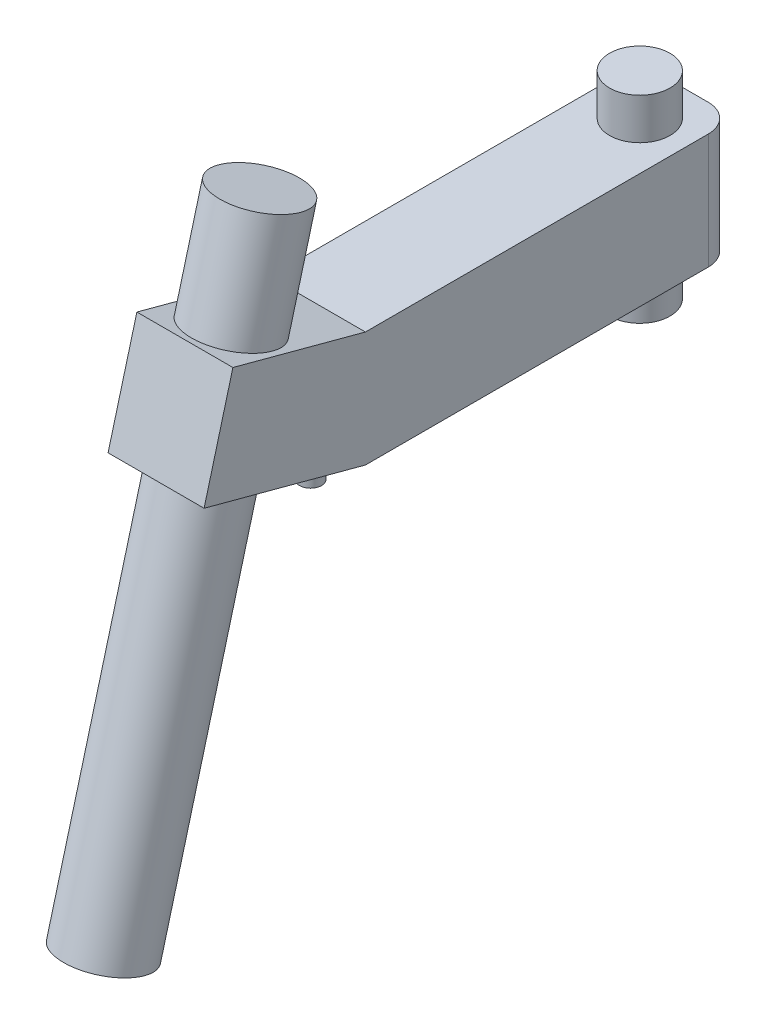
ISO-10303-21;
HEADER;
FILE_DESCRIPTION(('STEP AP214'),'2;1');
FILE_NAME('part.step','',(''),(''),'','','');
FILE_SCHEMA(('AUTOMOTIVE_DESIGN { 1 0 10303 214 1 1 1 1 }'));
ENDSEC;
DATA;
#1=APPLICATION_CONTEXT('core data for automotive mechanical design processes');
#2=APPLICATION_PROTOCOL_DEFINITION('international standard','automotive_design',2000,#1);
#3=PRODUCT_CONTEXT('',#1,'mechanical');
#4=PRODUCT('Part','Part','',(#3));
#5=PRODUCT_RELATED_PRODUCT_CATEGORY('part','',(#4));
#6=PRODUCT_DEFINITION_FORMATION('','',#4);
#7=PRODUCT_DEFINITION_CONTEXT('part definition',#1,'design');
#8=PRODUCT_DEFINITION('design','',#6,#7);
#9=PRODUCT_DEFINITION_SHAPE('','',#8);
#10=(LENGTH_UNIT() NAMED_UNIT(*) SI_UNIT(.MILLI.,.METRE.));
#11=(NAMED_UNIT(*) PLANE_ANGLE_UNIT() SI_UNIT($,.RADIAN.));
#12=(NAMED_UNIT(*) SI_UNIT($,.STERADIAN.) SOLID_ANGLE_UNIT());
#13=UNCERTAINTY_MEASURE_WITH_UNIT(LENGTH_MEASURE(1.E-05),#10,'distance_accuracy_value','');
#14=(GEOMETRIC_REPRESENTATION_CONTEXT(3) GLOBAL_UNCERTAINTY_ASSIGNED_CONTEXT((#13)) GLOBAL_UNIT_ASSIGNED_CONTEXT((#10,
#11,#12)) REPRESENTATION_CONTEXT('',''));
#15=CARTESIAN_POINT('',(0.,0.,0.));
#16=DIRECTION('',(0.,0.,1.));
#17=DIRECTION('',(1.,0.,0.));
#18=AXIS2_PLACEMENT_3D('',#15,#16,#17);
#19=CARTESIAN_POINT('',(87.5,-26.2279061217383,881.481456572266));
#20=DIRECTION('',(0.,0.96592582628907,-0.258819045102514));
#21=DIRECTION('',(0.,0.258819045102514,0.96592582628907));
#22=AXIS2_PLACEMENT_3D('',#19,#20,#21);
#23=PLANE('',#22);
#24=DIRECTION('',(1.,0.,0.));
#25=VECTOR('',#24,1.);
#26=CARTESIAN_POINT('',(-87.4999999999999,-105.,587.5));
#27=LINE('',#26,#25);
#28=CARTESIAN_POINT('',(-15.612494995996,-105.,587.5));
#29=VERTEX_POINT('',#28);
#30=CARTESIAN_POINT('',(15.612494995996,-105.,587.5));
#31=VERTEX_POINT('',#30);
#32=EDGE_CURVE('E12',#29,#31,#27,.T.);
#33=ORIENTED_EDGE('',*,*,#32,.F.);
#34=CARTESIAN_POINT('',(0.,-101.650635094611,600.));
#35=DIRECTION('',(0.,0.96592582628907,-0.258819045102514));
#36=DIRECTION('',(0.,-0.258819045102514,-0.96592582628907));
#37=AXIS2_PLACEMENT_3D('',#34,#35,#36);
#38=ELLIPSE('',#37,20.7055236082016,20.);
#39=EDGE_CURVE('E56',#31,#29,#38,.F.);
#40=ORIENTED_EDGE('',*,*,#39,.F.);
#41=EDGE_LOOP('',(#33,#40));
#42=FACE_BOUND('',#41,.T.);
#43=ADVANCED_FACE('F48',(#42),#23,.T.);
#44=CARTESIAN_POINT('',(0.,180.002,600.));
#45=DIRECTION('',(0.,-1.,0.));
#46=DIRECTION('',(0.,0.,-1.));
#47=AXIS2_PLACEMENT_3D('',#44,#45,#46);
#48=CYLINDRICAL_SURFACE('',#47,20.);
#49=ORIENTED_EDGE('',*,*,#39,.T.);
#50=CARTESIAN_POINT('',(0.,-105.,600.));
#51=DIRECTION('',(0.,-1.,0.));
#52=DIRECTION('',(0.,0.,-1.));
#53=AXIS2_PLACEMENT_3D('',#50,#51,#52);
#54=CIRCLE('',#53,20.);
#55=EDGE_CURVE('E68',#29,#31,#54,.T.);
#56=ORIENTED_EDGE('',*,*,#55,.T.);
#57=EDGE_LOOP('',(#49,#56));
#58=FACE_BOUND('',#57,.T.);
#59=CARTESIAN_POINT('',(0.,-165.,600.));
#60=DIRECTION('',(0.,-1.,0.));
#61=DIRECTION('',(0.,0.,-1.));
#62=AXIS2_PLACEMENT_3D('',#59,#60,#61);
#63=CIRCLE('',#62,20.);
#64=CARTESIAN_POINT('',(0.,-165.,580.));
#65=VERTEX_POINT('',#64);
#66=EDGE_CURVE('E65',#65,#65,#63,.T.);
#67=ORIENTED_EDGE('',*,*,#66,.F.);
#68=EDGE_LOOP('',(#67));
#69=FACE_BOUND('',#68,.T.);
#70=ADVANCED_FACE('F50',(#58,#69),#48,.T.);
#71=CARTESIAN_POINT('',(0.,-105.,600.));
#72=DIRECTION('',(0.,-1.,0.));
#73=DIRECTION('',(0.,0.,-1.));
#74=AXIS2_PLACEMENT_3D('',#71,#72,#73);
#75=PLANE('',#74);
#76=ORIENTED_EDGE('',*,*,#55,.F.);
#77=ORIENTED_EDGE('',*,*,#32,.T.);
#78=EDGE_LOOP('',(#76,#77));
#79=FACE_BOUND('',#78,.T.);
#80=ADVANCED_FACE('F67',(#79),#75,.F.);
#81=CARTESIAN_POINT('',(0.,-165.,600.));
#82=DIRECTION('',(0.,-1.,0.));
#83=DIRECTION('',(0.,0.,-1.));
#84=AXIS2_PLACEMENT_3D('',#81,#82,#83);
#85=PLANE('',#84);
#86=ORIENTED_EDGE('',*,*,#66,.T.);
#87=EDGE_LOOP('',(#86));
#88=FACE_BOUND('',#87,.T.);
#89=ADVANCED_FACE('F75',(#88),#85,.T.);
#90=CLOSED_SHELL('',(#43,#70,#80,#89));
#91=MANIFOLD_SOLID_BREP('B2',#90);
#92=CARTESIAN_POINT('',(0.,-722.275148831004,977.400087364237));
#93=DIRECTION('',(0.,0.96592582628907,-0.258819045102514));
#94=DIRECTION('',(0.,0.258819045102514,0.96592582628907));
#95=AXIS2_PLACEMENT_3D('',#92,#93,#94);
#96=CYLINDRICAL_SURFACE('',#95,75.0000000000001);
#97=CARTESIAN_POINT('',(0.,-722.275148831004,977.400087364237));
#98=DIRECTION('',(0.,0.96592582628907,-0.258819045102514));
#99=DIRECTION('',(0.,0.258819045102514,0.96592582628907));
#100=AXIS2_PLACEMENT_3D('',#97,#98,#99);
#101=CIRCLE('',#100,75.0000000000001);
#102=CARTESIAN_POINT('',(0.,-702.863720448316,1049.84452433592));
#103=VERTEX_POINT('',#102);
#104=EDGE_CURVE('E47',#103,#103,#101,.T.);
#105=ORIENTED_EDGE('',*,*,#104,.T.);
#106=EDGE_LOOP('',(#105));
#107=FACE_BOUND('',#106,.T.);
#108=CARTESIAN_POINT('',(0.,340.243260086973,692.699137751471));
#109=DIRECTION('',(0.,0.96592582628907,-0.258819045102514));
#110=DIRECTION('',(0.,0.258819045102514,0.96592582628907));
#111=AXIS2_PLACEMENT_3D('',#108,#109,#110);
#112=CIRCLE('',#111,75.0000000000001);
#113=CARTESIAN_POINT('',(0.,359.654688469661,765.143574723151));
#114=VERTEX_POINT('',#113);
#115=EDGE_CURVE('E132',#114,#114,#112,.T.);
#116=ORIENTED_EDGE('',*,*,#115,.F.);
#117=EDGE_LOOP('',(#116));
#118=FACE_BOUND('',#117,.T.);
#119=ADVANCED_FACE('F126',(#107,#118),#96,.T.);
#120=CARTESIAN_POINT('',(0.,-722.275148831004,977.400087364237));
#121=DIRECTION('',(0.,0.96592582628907,-0.258819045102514));
#122=DIRECTION('',(0.,0.258819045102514,0.96592582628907));
#123=AXIS2_PLACEMENT_3D('',#120,#121,#122);
#124=PLANE('',#123);
#125=CARTESIAN_POINT('',(0.,-722.275148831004,977.400087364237));
#126=DIRECTION('',(0.,-0.96592582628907,0.258819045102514));
#127=DIRECTION('',(0.,-0.258819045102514,-0.96592582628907));
#128=AXIS2_PLACEMENT_3D('',#125,#126,#127);
#129=CIRCLE('',#128,60.);
#130=CARTESIAN_POINT('',(0.,-737.804291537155,919.444537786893));
#131=VERTEX_POINT('',#130);
#132=EDGE_CURVE('E140',#131,#131,#129,.T.);
#133=ORIENTED_EDGE('',*,*,#132,.F.);
#134=EDGE_LOOP('',(#133));
#135=FACE_BOUND('',#134,.T.);
#136=ORIENTED_EDGE('',*,*,#104,.F.);
#137=EDGE_LOOP('',(#136));
#138=FACE_BOUND('',#137,.T.);
#139=ADVANCED_FACE('F148',(#135,#138),#124,.F.);
#140=CARTESIAN_POINT('',(0.,340.243260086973,692.699137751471));
#141=DIRECTION('',(0.,0.96592582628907,-0.258819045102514));
#142=DIRECTION('',(0.,0.258819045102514,0.96592582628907));
#143=AXIS2_PLACEMENT_3D('',#140,#141,#142);
#144=PLANE('',#143);
#145=ORIENTED_EDGE('',*,*,#115,.T.);
#146=EDGE_LOOP('',(#145));
#147=FACE_BOUND('',#146,.T.);
#148=ADVANCED_FACE('F151',(#147),#144,.T.);
#149=CARTESIAN_POINT('',(0.,291.946968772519,705.640090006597));
#150=DIRECTION('',(0.,-0.96592582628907,0.258819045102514));
#151=DIRECTION('',(0.,-0.258819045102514,-0.96592582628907));
#152=AXIS2_PLACEMENT_3D('',#149,#150,#151);
#153=CYLINDRICAL_SURFACE('',#152,60.);
#154=CARTESIAN_POINT('',(0.,291.946968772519,705.640090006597));
#155=DIRECTION('',(0.,-0.96592582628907,0.258819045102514));
#156=DIRECTION('',(0.,-0.258819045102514,-0.96592582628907));
#157=AXIS2_PLACEMENT_3D('',#154,#155,#156);
#158=CIRCLE('',#157,60.);
#159=CARTESIAN_POINT('',(0.,276.417826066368,647.684540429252));
#160=VERTEX_POINT('',#159);
#161=EDGE_CURVE('E136',#160,#160,#158,.T.);
#162=ORIENTED_EDGE('',*,*,#161,.F.);
#163=EDGE_LOOP('',(#162));
#164=FACE_BOUND('',#163,.T.);
#165=ORIENTED_EDGE('',*,*,#132,.T.);
#166=EDGE_LOOP('',(#165));
#167=FACE_BOUND('',#166,.T.);
#168=ADVANCED_FACE('F146',(#164,#167),#153,.F.);
#169=CARTESIAN_POINT('',(0.,291.946968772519,705.640090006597));
#170=DIRECTION('',(0.,-0.96592582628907,0.258819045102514));
#171=DIRECTION('',(0.,-0.258819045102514,-0.96592582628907));
#172=AXIS2_PLACEMENT_3D('',#169,#170,#171);
#173=PLANE('',#172);
#174=ORIENTED_EDGE('',*,*,#161,.T.);
#175=EDGE_LOOP('',(#174));
#176=FACE_BOUND('',#175,.T.);
#177=ADVANCED_FACE('F160',(#176),#173,.T.);
#178=CLOSED_SHELL('',(#119,#139,#148,#168,#177));
#179=MANIFOLD_SOLID_BREP('B6',#178);
#180=CARTESIAN_POINT('',(0.,180.,0.));
#181=DIRECTION('',(0.,-1.,0.));
#182=DIRECTION('',(0.,0.,-1.));
#183=AXIS2_PLACEMENT_3D('',#180,#181,#182);
#184=CYLINDRICAL_SURFACE('',#183,55.);
#185=CARTESIAN_POINT('',(0.,-180.,0.));
#186=DIRECTION('',(0.,1.,0.));
#187=DIRECTION('',(0.,0.,1.));
#188=AXIS2_PLACEMENT_3D('',#185,#186,#187);
#189=CIRCLE('',#188,55.);
#190=CARTESIAN_POINT('',(0.,-180.,-55.));
#191=VERTEX_POINT('',#190);
#192=EDGE_CURVE('E331',#191,#191,#189,.T.);
#193=CARTESIAN_POINT('',(0.,-105.,0.));
#194=DIRECTION('',(0.,1.,0.));
#195=DIRECTION('',(0.,0.,1.));
#196=AXIS2_PLACEMENT_3D('',#193,#194,#195);
#197=CIRCLE('',#196,55.);
#198=CARTESIAN_POINT('',(0.,-105.,-55.));
#199=VERTEX_POINT('',#198);
#200=EDGE_CURVE('E330',#199,#199,#197,.T.);
#201=CARTESIAN_POINT('',(0.,-180.,-55.));
#202=CARTESIAN_POINT('',(0.,-179.21875,-55.));
#203=CARTESIAN_POINT('',(0.,-178.4375,-55.));
#204=CARTESIAN_POINT('',(0.,-176.875,-55.));
#205=CARTESIAN_POINT('',(0.,-176.09375,-55.));
#206=CARTESIAN_POINT('',(0.,-174.53125,-55.));
#207=CARTESIAN_POINT('',(0.,-173.75,-55.));
#208=CARTESIAN_POINT('',(0.,-172.1875,-55.));
#209=CARTESIAN_POINT('',(0.,-171.40625,-55.));
#210=CARTESIAN_POINT('',(0.,-169.84375,-55.));
#211=CARTESIAN_POINT('',(0.,-169.0625,-55.));
#212=CARTESIAN_POINT('',(0.,-167.5,-55.));
#213=CARTESIAN_POINT('',(0.,-166.71875,-55.));
#214=CARTESIAN_POINT('',(0.,-165.15625,-55.));
#215=CARTESIAN_POINT('',(0.,-164.375,-55.));
#216=CARTESIAN_POINT('',(0.,-162.8125,-55.));
#217=CARTESIAN_POINT('',(0.,-162.03125,-55.));
#218=CARTESIAN_POINT('',(0.,-160.46875,-55.));
#219=CARTESIAN_POINT('',(0.,-159.6875,-55.));
#220=CARTESIAN_POINT('',(0.,-158.125,-55.));
#221=CARTESIAN_POINT('',(0.,-157.34375,-55.));
#222=CARTESIAN_POINT('',(0.,-155.78125,-55.));
#223=CARTESIAN_POINT('',(0.,-155.,-55.));
#224=CARTESIAN_POINT('',(0.,-153.4375,-55.));
#225=CARTESIAN_POINT('',(0.,-152.65625,-55.));
#226=CARTESIAN_POINT('',(0.,-151.09375,-55.));
#227=CARTESIAN_POINT('',(0.,-150.3125,-55.));
#228=CARTESIAN_POINT('',(0.,-148.75,-55.));
#229=CARTESIAN_POINT('',(0.,-147.96875,-55.));
#230=CARTESIAN_POINT('',(0.,-146.40625,-55.));
#231=CARTESIAN_POINT('',(0.,-145.625,-55.));
#232=CARTESIAN_POINT('',(0.,-144.0625,-55.));
#233=CARTESIAN_POINT('',(0.,-143.28125,-55.));
#234=CARTESIAN_POINT('',(0.,-141.71875,-55.));
#235=CARTESIAN_POINT('',(0.,-140.9375,-55.));
#236=CARTESIAN_POINT('',(0.,-139.375,-55.));
#237=CARTESIAN_POINT('',(0.,-138.59375,-55.));
#238=CARTESIAN_POINT('',(0.,-137.03125,-55.));
#239=CARTESIAN_POINT('',(0.,-136.25,-55.));
#240=CARTESIAN_POINT('',(0.,-134.6875,-55.));
#241=CARTESIAN_POINT('',(0.,-133.90625,-55.));
#242=CARTESIAN_POINT('',(0.,-132.34375,-55.));
#243=CARTESIAN_POINT('',(0.,-131.5625,-55.));
#244=CARTESIAN_POINT('',(0.,-130.,-55.));
#245=CARTESIAN_POINT('',(0.,-129.21875,-55.));
#246=CARTESIAN_POINT('',(0.,-127.65625,-55.));
#247=CARTESIAN_POINT('',(0.,-126.875,-55.));
#248=CARTESIAN_POINT('',(0.,-125.3125,-55.));
#249=CARTESIAN_POINT('',(0.,-124.53125,-55.));
#250=CARTESIAN_POINT('',(0.,-122.96875,-55.));
#251=CARTESIAN_POINT('',(0.,-122.1875,-55.));
#252=CARTESIAN_POINT('',(0.,-120.625,-55.));
#253=CARTESIAN_POINT('',(0.,-119.84375,-55.));
#254=CARTESIAN_POINT('',(0.,-118.28125,-55.));
#255=CARTESIAN_POINT('',(0.,-117.5,-55.));
#256=CARTESIAN_POINT('',(0.,-115.9375,-55.));
#257=CARTESIAN_POINT('',(0.,-115.15625,-55.));
#258=CARTESIAN_POINT('',(0.,-113.59375,-55.));
#259=CARTESIAN_POINT('',(0.,-112.8125,-55.));
#260=CARTESIAN_POINT('',(0.,-111.25,-55.));
#261=CARTESIAN_POINT('',(0.,-110.46875,-55.));
#262=CARTESIAN_POINT('',(0.,-108.90625,-55.));
#263=CARTESIAN_POINT('',(0.,-108.125,-55.));
#264=CARTESIAN_POINT('',(0.,-106.5625,-55.));
#265=CARTESIAN_POINT('',(0.,-105.78125,-55.));
#266=CARTESIAN_POINT('',(0.,-105.,-55.));
#267=B_SPLINE_CURVE_WITH_KNOTS('',3,(#201,#202,#203,#204,#205,#206,#207,#208,#209,#210,#211,
#212,#213,#214,#215,#216,#217,#218,#219,#220,#221,#222,#223,#224,#225,#226,#227,#228,#229,#230,
#231,#232,#233,#234,#235,#236,#237,#238,#239,#240,#241,#242,#243,#244,#245,#246,#247,#248,#249,
#250,#251,#252,#253,#254,#255,#256,#257,#258,#259,#260,#261,#262,#263,#264,#265,#266),
.UNSPECIFIED.,.F.,.F.,(4,2,2,2,2,2,2,2,2,2,2,2,2,2,2,2,2,2,2,2,2,2,2,2,2,2,2,2,2,2,2,2,4),(0.,
2.34374999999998,4.68750000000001,7.03124999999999,9.37500000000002,11.71875,14.0625,16.40625,
18.75,21.09375,23.4375,25.78125,28.125,30.46875,32.8125,35.15625,37.5,39.8437500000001,42.1875,
44.53125,46.8750000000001,49.21875,51.5625000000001,53.90625,56.25,58.5937500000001,60.9375,
63.2812500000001,65.625,67.9687500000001,70.3125000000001,72.6562500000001,75.0000000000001),.UNSPECIFIED.);
#268=EDGE_CURVE('BSEAM207',#191,#199,#267,.T.);
#269=ORIENTED_EDGE('',*,*,#192,.T.);
#270=ORIENTED_EDGE('',*,*,#200,.F.);
#271=ORIENTED_EDGE('',*,*,#268,.T.);
#272=ORIENTED_EDGE('',*,*,#268,.F.);
#273=EDGE_LOOP('',(#269,#271,#270,#272));
#274=FACE_BOUND('',#273,.T.);
#275=ADVANCED_FACE('F207',(#274),#184,.T.);
#276=CARTESIAN_POINT('',(0.,-180.,0.));
#277=DIRECTION('',(0.,1.,0.));
#278=DIRECTION('',(0.,0.,1.));
#279=AXIS2_PLACEMENT_3D('',#276,#277,#278);
#280=PLANE('',#279);
#281=ORIENTED_EDGE('',*,*,#192,.F.);
#282=EDGE_LOOP('',(#281));
#283=FACE_BOUND('',#282,.T.);
#284=ADVANCED_FACE('F378',(#283),#280,.F.);
#285=CARTESIAN_POINT('',(0.,-105.,0.));
#286=DIRECTION('',(0.,1.,0.));
#287=DIRECTION('',(0.,0.,1.));
#288=AXIS2_PLACEMENT_3D('',#285,#286,#287);
#289=PLANE('',#288);
#290=ORIENTED_EDGE('',*,*,#200,.T.);
#291=EDGE_LOOP('',(#290));
#292=FACE_BOUND('',#291,.T.);
#293=DIRECTION('',(-1.,0.,0.));
#294=VECTOR('',#293,1.);
#295=CARTESIAN_POINT('',(-87.5,-105.,-87.5));
#296=LINE('',#295,#294);
#297=CARTESIAN_POINT('',(37.5,-105.,-87.5));
#298=VERTEX_POINT('',#297);
#299=CARTESIAN_POINT('',(-37.5,-105.,-87.5));
#300=VERTEX_POINT('',#299);
#301=EDGE_CURVE('E320',#298,#300,#296,.T.);
#302=ORIENTED_EDGE('',*,*,#301,.F.);
#303=CARTESIAN_POINT('',(37.5,-105.,-37.5));
#304=DIRECTION('',(0.,1.,0.));
#305=DIRECTION('',(0.,0.,1.));
#306=AXIS2_PLACEMENT_3D('',#303,#304,#305);
#307=CIRCLE('',#306,50.);
#308=CARTESIAN_POINT('',(87.5,-105.,-37.5));
#309=VERTEX_POINT('',#308);
#310=EDGE_CURVE('E348',#298,#309,#307,.F.);
#311=ORIENTED_EDGE('',*,*,#310,.T.);
#312=DIRECTION('',(0.,0.,-1.));
#313=VECTOR('',#312,1.);
#314=CARTESIAN_POINT('',(87.5000000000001,-105.,587.5));
#315=LINE('',#314,#313);
#316=CARTESIAN_POINT('',(87.5000000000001,-105.,587.5));
#317=VERTEX_POINT('',#316);
#318=EDGE_CURVE('E292',#317,#309,#315,.T.);
#319=ORIENTED_EDGE('',*,*,#318,.F.);
#320=DIRECTION('',(1.,0.,0.));
#321=VECTOR('',#320,1.);
#322=CARTESIAN_POINT('',(-87.4999999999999,-105.,587.5));
#323=LINE('',#322,#321);
#324=CARTESIAN_POINT('',(-87.5,-105.,587.5));
#325=VERTEX_POINT('',#324);
#326=EDGE_CURVE('E312',#325,#317,#323,.T.);
#327=ORIENTED_EDGE('',*,*,#326,.F.);
#328=DIRECTION('',(0.,0.,1.));
#329=VECTOR('',#328,1.);
#330=CARTESIAN_POINT('',(-87.4999999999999,-105.,587.5));
#331=LINE('',#330,#329);
#332=CARTESIAN_POINT('',(-87.5,-105.,-37.5));
#333=VERTEX_POINT('',#332);
#334=EDGE_CURVE('E323',#333,#325,#331,.T.);
#335=ORIENTED_EDGE('',*,*,#334,.F.);
#336=CARTESIAN_POINT('',(-37.5,-105.,-37.5));
#337=DIRECTION('',(0.,1.,0.));
#338=DIRECTION('',(0.,0.,1.));
#339=AXIS2_PLACEMENT_3D('',#336,#337,#338);
#340=CIRCLE('',#339,50.);
#341=EDGE_CURVE('E346',#333,#300,#340,.F.);
#342=ORIENTED_EDGE('',*,*,#341,.T.);
#343=EDGE_LOOP('',(#302,#311,#319,#327,#335,#342));
#344=FACE_BOUND('',#343,.T.);
#345=ADVANCED_FACE('F362',(#292,#344),#289,.F.);
#346=CARTESIAN_POINT('',(0.,105.,0.));
#347=DIRECTION('',(0.,1.,0.));
#348=DIRECTION('',(0.,0.,1.));
#349=AXIS2_PLACEMENT_3D('',#346,#347,#348);
#350=PLANE('',#349);
#351=CARTESIAN_POINT('',(0.,105.,0.));
#352=DIRECTION('',(0.,1.,0.));
#353=DIRECTION('',(0.,0.,1.));
#354=AXIS2_PLACEMENT_3D('',#351,#352,#353);
#355=CIRCLE('',#354,55.);
#356=CARTESIAN_POINT('',(0.,105.,-55.));
#357=VERTEX_POINT('',#356);
#358=EDGE_CURVE('E318',#357,#357,#355,.T.);
#359=ORIENTED_EDGE('',*,*,#358,.F.);
#360=EDGE_LOOP('',(#359));
#361=FACE_BOUND('',#360,.T.);
#362=DIRECTION('',(0.,0.,-1.));
#363=VECTOR('',#362,1.);
#364=CARTESIAN_POINT('',(87.5000000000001,105.,587.5));
#365=LINE('',#364,#363);
#366=CARTESIAN_POINT('',(87.5000000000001,105.,587.5));
#367=VERTEX_POINT('',#366);
#368=CARTESIAN_POINT('',(87.5,105.,-37.5));
#369=VERTEX_POINT('',#368);
#370=EDGE_CURVE('E280',#367,#369,#365,.T.);
#371=ORIENTED_EDGE('',*,*,#370,.T.);
#372=CARTESIAN_POINT('',(37.5,105.,-37.5));
#373=DIRECTION('',(0.,1.,0.));
#374=DIRECTION('',(0.,0.,1.));
#375=AXIS2_PLACEMENT_3D('',#372,#373,#374);
#376=CIRCLE('',#375,50.);
#377=CARTESIAN_POINT('',(37.5,105.,-87.5));
#378=VERTEX_POINT('',#377);
#379=EDGE_CURVE('E215',#369,#378,#376,.T.);
#380=ORIENTED_EDGE('',*,*,#379,.T.);
#381=DIRECTION('',(-1.,0.,0.));
#382=VECTOR('',#381,1.);
#383=CARTESIAN_POINT('',(-87.5,105.,-87.5));
#384=LINE('',#383,#382);
#385=CARTESIAN_POINT('',(-37.5,105.,-87.5));
#386=VERTEX_POINT('',#385);
#387=EDGE_CURVE('E311',#378,#386,#384,.T.);
#388=ORIENTED_EDGE('',*,*,#387,.T.);
#389=CARTESIAN_POINT('',(-37.5,105.,-37.5));
#390=DIRECTION('',(0.,1.,0.));
#391=DIRECTION('',(0.,0.,1.));
#392=AXIS2_PLACEMENT_3D('',#389,#390,#391);
#393=CIRCLE('',#392,50.);
#394=CARTESIAN_POINT('',(-87.5,105.,-37.5));
#395=VERTEX_POINT('',#394);
#396=EDGE_CURVE('E222',#386,#395,#393,.T.);
#397=ORIENTED_EDGE('',*,*,#396,.T.);
#398=DIRECTION('',(0.,0.,1.));
#399=VECTOR('',#398,1.);
#400=CARTESIAN_POINT('',(-87.4999999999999,105.,587.5));
#401=LINE('',#400,#399);
#402=CARTESIAN_POINT('',(-87.4999999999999,105.,587.5));
#403=VERTEX_POINT('',#402);
#404=EDGE_CURVE('E314',#395,#403,#401,.T.);
#405=ORIENTED_EDGE('',*,*,#404,.T.);
#406=DIRECTION('',(1.,0.,0.));
#407=VECTOR('',#406,1.);
#408=CARTESIAN_POINT('',(-87.4999999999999,105.,587.5));
#409=LINE('',#408,#407);
#410=EDGE_CURVE('E316',#403,#367,#409,.T.);
#411=ORIENTED_EDGE('',*,*,#410,.T.);
#412=EDGE_LOOP('',(#371,#380,#388,#397,#405,#411));
#413=FACE_BOUND('',#412,.T.);
#414=ADVANCED_FACE('F353',(#361,#413),#350,.T.);
#415=CARTESIAN_POINT('',(-87.5,105.,-87.5));
#416=DIRECTION('',(0.,0.,1.));
#417=DIRECTION('',(1.,0.,0.));
#418=AXIS2_PLACEMENT_3D('',#415,#416,#417);
#419=PLANE('',#418);
#420=ORIENTED_EDGE('',*,*,#387,.F.);
#421=DIRECTION('',(0.,-1.,0.));
#422=VECTOR('',#421,1.);
#423=CARTESIAN_POINT('',(37.5,105.,-87.5));
#424=LINE('',#423,#422);
#425=EDGE_CURVE('E343',#378,#298,#424,.T.);
#426=ORIENTED_EDGE('',*,*,#425,.T.);
#427=ORIENTED_EDGE('',*,*,#301,.T.);
#428=DIRECTION('',(0.,-1.,0.));
#429=VECTOR('',#428,1.);
#430=CARTESIAN_POINT('',(-37.5,105.,-87.5));
#431=LINE('',#430,#429);
#432=EDGE_CURVE('E338',#300,#386,#431,.F.);
#433=ORIENTED_EDGE('',*,*,#432,.T.);
#434=EDGE_LOOP('',(#420,#426,#427,#433));
#435=FACE_BOUND('',#434,.T.);
#436=ADVANCED_FACE('F357',(#435),#419,.F.);
#437=CARTESIAN_POINT('',(-87.4999999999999,105.,587.5));
#438=DIRECTION('',(1.,0.,0.));
#439=DIRECTION('',(0.,0.,-1.));
#440=AXIS2_PLACEMENT_3D('',#437,#438,#439);
#441=PLANE('',#440);
#442=ORIENTED_EDGE('',*,*,#404,.F.);
#443=DIRECTION('',(0.,-1.,0.));
#444=VECTOR('',#443,1.);
#445=CARTESIAN_POINT('',(-87.5,105.,-37.5));
#446=LINE('',#445,#444);
#447=EDGE_CURVE('E124',#395,#333,#446,.T.);
#448=ORIENTED_EDGE('',*,*,#447,.T.);
#449=ORIENTED_EDGE('',*,*,#334,.T.);
#450=DIRECTION('',(0.,-0.258819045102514,-0.96592582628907));
#451=VECTOR('',#450,1.);
#452=CARTESIAN_POINT('',(-87.5,-26.2279061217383,881.481456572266));
#453=LINE('',#452,#451);
#454=CARTESIAN_POINT('',(-87.5,-26.2279061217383,881.481456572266));
#455=VERTEX_POINT('',#454);
#456=EDGE_CURVE('E283',#455,#325,#453,.T.);
#457=ORIENTED_EDGE('',*,*,#456,.F.);
#458=DIRECTION('',(0.,-0.96592582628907,0.258819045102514));
#459=VECTOR('',#458,1.);
#460=CARTESIAN_POINT('',(-87.5,169.704761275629,828.981456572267));
#461=LINE('',#460,#459);
#462=CARTESIAN_POINT('',(-87.5,169.704761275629,828.981456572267));
#463=VERTEX_POINT('',#462);
#464=EDGE_CURVE('E304',#463,#455,#461,.T.);
#465=ORIENTED_EDGE('',*,*,#464,.F.);
#466=DIRECTION('',(0.,0.258819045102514,0.96592582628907));
#467=VECTOR('',#466,1.);
#468=CARTESIAN_POINT('',(-87.5,105.,587.5));
#469=LINE('',#468,#467);
#470=EDGE_CURVE('E289',#403,#463,#469,.T.);
#471=ORIENTED_EDGE('',*,*,#470,.F.);
#472=EDGE_LOOP('',(#442,#448,#449,#457,#465,#471));
#473=FACE_BOUND('',#472,.T.);
#474=ADVANCED_FACE('F369',(#473),#441,.F.);
#475=CARTESIAN_POINT('',(87.5000000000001,105.,587.5));
#476=DIRECTION('',(-1.,0.,0.));
#477=DIRECTION('',(0.,0.,1.));
#478=AXIS2_PLACEMENT_3D('',#475,#476,#477);
#479=PLANE('',#478);
#480=ORIENTED_EDGE('',*,*,#318,.T.);
#481=DIRECTION('',(0.,-1.,0.));
#482=VECTOR('',#481,1.);
#483=CARTESIAN_POINT('',(87.5,105.,-37.5));
#484=LINE('',#483,#482);
#485=EDGE_CURVE('E230',#309,#369,#484,.F.);
#486=ORIENTED_EDGE('',*,*,#485,.T.);
#487=ORIENTED_EDGE('',*,*,#370,.F.);
#488=DIRECTION('',(0.,0.258819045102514,0.96592582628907));
#489=VECTOR('',#488,1.);
#490=CARTESIAN_POINT('',(87.5,105.,587.5));
#491=LINE('',#490,#489);
#492=CARTESIAN_POINT('',(87.5,169.704761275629,828.981456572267));
#493=VERTEX_POINT('',#492);
#494=EDGE_CURVE('E273',#367,#493,#491,.T.);
#495=ORIENTED_EDGE('',*,*,#494,.T.);
#496=DIRECTION('',(0.,-0.96592582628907,0.258819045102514));
#497=VECTOR('',#496,1.);
#498=CARTESIAN_POINT('',(87.5,169.704761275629,828.981456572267));
#499=LINE('',#498,#497);
#500=CARTESIAN_POINT('',(87.5,-26.2279061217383,881.481456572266));
#501=VERTEX_POINT('',#500);
#502=EDGE_CURVE('E278',#493,#501,#499,.T.);
#503=ORIENTED_EDGE('',*,*,#502,.T.);
#504=DIRECTION('',(0.,-0.258819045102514,-0.96592582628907));
#505=VECTOR('',#504,1.);
#506=CARTESIAN_POINT('',(87.5,-26.2279061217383,881.481456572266));
#507=LINE('',#506,#505);
#508=EDGE_CURVE('E298',#501,#317,#507,.T.);
#509=ORIENTED_EDGE('',*,*,#508,.T.);
#510=EDGE_LOOP('',(#480,#486,#487,#495,#503,#509));
#511=FACE_BOUND('',#510,.T.);
#512=ADVANCED_FACE('F275',(#511),#479,.F.);
#513=CARTESIAN_POINT('',(0.,180.,0.));
#514=DIRECTION('',(0.,1.,0.));
#515=DIRECTION('',(0.,0.,1.));
#516=AXIS2_PLACEMENT_3D('',#513,#514,#515);
#517=PLANE('',#516);
#518=CARTESIAN_POINT('',(0.,180.,0.));
#519=DIRECTION('',(0.,1.,0.));
#520=DIRECTION('',(0.,0.,1.));
#521=AXIS2_PLACEMENT_3D('',#518,#519,#520);
#522=CIRCLE('',#521,55.);
#523=CARTESIAN_POINT('',(0.,180.,-55.));
#524=VERTEX_POINT('',#523);
#525=EDGE_CURVE('E327',#524,#524,#522,.T.);
#526=ORIENTED_EDGE('',*,*,#525,.T.);
#527=EDGE_LOOP('',(#526));
#528=FACE_BOUND('',#527,.T.);
#529=ADVANCED_FACE('F389',(#528),#517,.T.);
#530=CARTESIAN_POINT('',(0.,105.,-55.));
#531=CARTESIAN_POINT('',(0.,105.78125,-55.));
#532=CARTESIAN_POINT('',(0.,106.5625,-55.));
#533=CARTESIAN_POINT('',(0.,108.125,-55.));
#534=CARTESIAN_POINT('',(0.,108.90625,-55.));
#535=CARTESIAN_POINT('',(0.,110.46875,-55.));
#536=CARTESIAN_POINT('',(0.,111.25,-55.));
#537=CARTESIAN_POINT('',(0.,112.8125,-55.));
#538=CARTESIAN_POINT('',(0.,113.59375,-55.));
#539=CARTESIAN_POINT('',(0.,115.15625,-55.));
#540=CARTESIAN_POINT('',(0.,115.9375,-55.));
#541=CARTESIAN_POINT('',(0.,117.5,-55.));
#542=CARTESIAN_POINT('',(0.,118.28125,-55.));
#543=CARTESIAN_POINT('',(0.,119.84375,-55.));
#544=CARTESIAN_POINT('',(0.,120.625,-55.));
#545=CARTESIAN_POINT('',(0.,122.1875,-55.));
#546=CARTESIAN_POINT('',(0.,122.96875,-55.));
#547=CARTESIAN_POINT('',(0.,124.53125,-55.));
#548=CARTESIAN_POINT('',(0.,125.3125,-55.));
#549=CARTESIAN_POINT('',(0.,126.875,-55.));
#550=CARTESIAN_POINT('',(0.,127.65625,-55.));
#551=CARTESIAN_POINT('',(0.,129.21875,-55.));
#552=CARTESIAN_POINT('',(0.,130.,-55.));
#553=CARTESIAN_POINT('',(0.,131.5625,-55.));
#554=CARTESIAN_POINT('',(0.,132.34375,-55.));
#555=CARTESIAN_POINT('',(0.,133.90625,-55.));
#556=CARTESIAN_POINT('',(0.,134.6875,-55.));
#557=CARTESIAN_POINT('',(0.,136.25,-55.));
#558=CARTESIAN_POINT('',(0.,137.03125,-55.));
#559=CARTESIAN_POINT('',(0.,138.59375,-55.));
#560=CARTESIAN_POINT('',(0.,139.375,-55.));
#561=CARTESIAN_POINT('',(0.,140.9375,-55.));
#562=CARTESIAN_POINT('',(0.,141.71875,-55.));
#563=CARTESIAN_POINT('',(0.,143.28125,-55.));
#564=CARTESIAN_POINT('',(0.,144.0625,-55.));
#565=CARTESIAN_POINT('',(0.,145.625,-55.));
#566=CARTESIAN_POINT('',(0.,146.40625,-55.));
#567=CARTESIAN_POINT('',(0.,147.96875,-55.));
#568=CARTESIAN_POINT('',(0.,148.75,-55.));
#569=CARTESIAN_POINT('',(0.,150.3125,-55.));
#570=CARTESIAN_POINT('',(0.,151.09375,-55.));
#571=CARTESIAN_POINT('',(0.,152.65625,-55.));
#572=CARTESIAN_POINT('',(0.,153.4375,-55.));
#573=CARTESIAN_POINT('',(0.,155.,-55.));
#574=CARTESIAN_POINT('',(0.,155.78125,-55.));
#575=CARTESIAN_POINT('',(0.,157.34375,-55.));
#576=CARTESIAN_POINT('',(0.,158.125,-55.));
#577=CARTESIAN_POINT('',(0.,159.6875,-55.));
#578=CARTESIAN_POINT('',(0.,160.46875,-55.));
#579=CARTESIAN_POINT('',(0.,162.03125,-55.));
#580=CARTESIAN_POINT('',(0.,162.8125,-55.));
#581=CARTESIAN_POINT('',(0.,164.375,-55.));
#582=CARTESIAN_POINT('',(0.,165.15625,-55.));
#583=CARTESIAN_POINT('',(0.,166.71875,-55.));
#584=CARTESIAN_POINT('',(0.,167.5,-55.));
#585=CARTESIAN_POINT('',(0.,169.0625,-55.));
#586=CARTESIAN_POINT('',(0.,169.84375,-55.));
#587=CARTESIAN_POINT('',(0.,171.40625,-55.));
#588=CARTESIAN_POINT('',(0.,172.1875,-55.));
#589=CARTESIAN_POINT('',(0.,173.75,-55.));
#590=CARTESIAN_POINT('',(0.,174.53125,-55.));
#591=CARTESIAN_POINT('',(0.,176.09375,-55.));
#592=CARTESIAN_POINT('',(0.,176.875,-55.));
#593=CARTESIAN_POINT('',(0.,178.4375,-55.));
#594=CARTESIAN_POINT('',(0.,179.21875,-55.));
#595=CARTESIAN_POINT('',(0.,180.,-55.));
#596=B_SPLINE_CURVE_WITH_KNOTS('',3,(#530,#531,#532,#533,#534,#535,#536,#537,#538,#539,#540,
#541,#542,#543,#544,#545,#546,#547,#548,#549,#550,#551,#552,#553,#554,#555,#556,#557,#558,#559,
#560,#561,#562,#563,#564,#565,#566,#567,#568,#569,#570,#571,#572,#573,#574,#575,#576,#577,#578,
#579,#580,#581,#582,#583,#584,#585,#586,#587,#588,#589,#590,#591,#592,#593,#594,#595),
.UNSPECIFIED.,.F.,.F.,(4,2,2,2,2,2,2,2,2,2,2,2,2,2,2,2,2,2,2,2,2,2,2,2,2,2,2,2,2,2,2,2,4),(0.,
2.34375000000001,4.6875,7.03125,9.37499999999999,11.71875,14.0625,16.40625,18.75,21.09375,
23.4375,25.78125,28.125,30.46875,32.8125,35.15625,37.5,39.84375,42.1875,44.53125,46.875,
49.21875,51.5625,53.90625,56.25,58.59375,60.9375,63.28125,65.625,67.96875,70.3125,72.65625,75.),.UNSPECIFIED.);
#597=EDGE_CURVE('BSEAM381',#357,#524,#596,.T.);
#598=ORIENTED_EDGE('',*,*,#358,.T.);
#599=ORIENTED_EDGE('',*,*,#525,.F.);
#600=ORIENTED_EDGE('',*,*,#597,.T.);
#601=ORIENTED_EDGE('',*,*,#597,.F.);
#602=EDGE_LOOP('',(#598,#600,#599,#601));
#603=FACE_BOUND('',#602,.T.);
#604=ADVANCED_FACE('F381',(#603),#184,.T.);
#605=CARTESIAN_POINT('',(87.5,105.,587.5));
#606=DIRECTION('',(0.,-0.96592582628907,0.258819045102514));
#607=DIRECTION('',(0.,-0.258819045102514,-0.96592582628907));
#608=AXIS2_PLACEMENT_3D('',#605,#606,#607);
#609=PLANE('',#608);
#610=CARTESIAN_POINT('',(0.,147.058094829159,744.462946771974));
#611=DIRECTION('',(0.,0.96592582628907,-0.258819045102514));
#612=DIRECTION('',(0.,0.258819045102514,0.96592582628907));
#613=AXIS2_PLACEMENT_3D('',#610,#611,#612);
#614=CIRCLE('',#613,75.0000000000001);
#615=CARTESIAN_POINT('',(0.,166.469523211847,816.907383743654));
#616=VERTEX_POINT('',#615);
#617=EDGE_CURVE('E341',#616,#616,#614,.T.);
#618=ORIENTED_EDGE('',*,*,#617,.F.);
#619=EDGE_LOOP('',(#618));
#620=FACE_BOUND('',#619,.T.);
#621=ORIENTED_EDGE('',*,*,#470,.T.);
#622=DIRECTION('',(-1.,0.,0.));
#623=VECTOR('',#622,1.);
#624=CARTESIAN_POINT('',(87.5,169.704761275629,828.981456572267));
#625=LINE('',#624,#623);
#626=EDGE_CURVE('E286',#493,#463,#625,.T.);
#627=ORIENTED_EDGE('',*,*,#626,.F.);
#628=ORIENTED_EDGE('',*,*,#494,.F.);
#629=ORIENTED_EDGE('',*,*,#410,.F.);
#630=EDGE_LOOP('',(#621,#627,#628,#629));
#631=FACE_BOUND('',#630,.T.);
#632=ADVANCED_FACE('F287',(#620,#631),#609,.F.);
#633=CARTESIAN_POINT('',(87.5,169.704761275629,828.981456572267));
#634=DIRECTION('',(0.,-0.258819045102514,-0.96592582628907));
#635=DIRECTION('',(0.,0.96592582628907,-0.258819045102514));
#636=AXIS2_PLACEMENT_3D('',#633,#634,#635);
#637=PLANE('',#636);
#638=ORIENTED_EDGE('',*,*,#464,.T.);
#639=DIRECTION('',(-1.,0.,0.));
#640=VECTOR('',#639,1.);
#641=CARTESIAN_POINT('',(87.5,-26.2279061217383,881.481456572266));
#642=LINE('',#641,#640);
#643=EDGE_CURVE('E293',#501,#455,#642,.T.);
#644=ORIENTED_EDGE('',*,*,#643,.F.);
#645=ORIENTED_EDGE('',*,*,#502,.F.);
#646=ORIENTED_EDGE('',*,*,#626,.T.);
#647=EDGE_LOOP('',(#638,#644,#645,#646));
#648=FACE_BOUND('',#647,.T.);
#649=ADVANCED_FACE('F295',(#648),#637,.F.);
#650=CARTESIAN_POINT('',(87.5,-26.2279061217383,881.481456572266));
#651=DIRECTION('',(0.,0.96592582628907,-0.258819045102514));
#652=DIRECTION('',(0.,0.258819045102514,0.96592582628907));
#653=AXIS2_PLACEMENT_3D('',#650,#651,#652);
#654=PLANE('',#653);
#655=CARTESIAN_POINT('',(0.,-48.8745725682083,796.962946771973));
#656=DIRECTION('',(0.,0.96592582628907,-0.258819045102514));
#657=DIRECTION('',(0.,0.258819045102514,0.96592582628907));
#658=AXIS2_PLACEMENT_3D('',#655,#656,#657);
#659=CIRCLE('',#658,75.0000000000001);
#660=CARTESIAN_POINT('',(0.,-29.4631441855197,869.407383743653));
#661=VERTEX_POINT('',#660);
#662=EDGE_CURVE('E305',#661,#661,#659,.T.);
#663=ORIENTED_EDGE('',*,*,#662,.T.);
#664=EDGE_LOOP('',(#663));
#665=FACE_BOUND('',#664,.T.);
#666=ORIENTED_EDGE('',*,*,#456,.T.);
#667=ORIENTED_EDGE('',*,*,#326,.T.);
#668=ORIENTED_EDGE('',*,*,#508,.F.);
#669=ORIENTED_EDGE('',*,*,#643,.T.);
#670=EDGE_LOOP('',(#666,#667,#668,#669));
#671=FACE_BOUND('',#670,.T.);
#672=ADVANCED_FACE('F365',(#665,#671),#654,.F.);
#673=CARTESIAN_POINT('',(0.,-192.34588935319,835.405970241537));
#674=DIRECTION('',(0.,0.96592582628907,-0.258819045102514));
#675=DIRECTION('',(0.,0.258819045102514,0.96592582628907));
#676=AXIS2_PLACEMENT_3D('',#673,#674,#675);
#677=CYLINDRICAL_SURFACE('',#676,75.0000000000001);
#678=ORIENTED_EDGE('',*,*,#617,.T.);
#679=EDGE_LOOP('',(#678));
#680=FACE_BOUND('',#679,.T.);
#681=ORIENTED_EDGE('',*,*,#662,.F.);
#682=EDGE_LOOP('',(#681));
#683=FACE_BOUND('',#682,.T.);
#684=ADVANCED_FACE('F376',(#680,#683),#677,.F.);
#685=CARTESIAN_POINT('',(37.5,105.,-37.5));
#686=DIRECTION('',(0.,-1.,0.));
#687=DIRECTION('',(0.,0.,-1.));
#688=AXIS2_PLACEMENT_3D('',#685,#686,#687);
#689=CYLINDRICAL_SURFACE('',#688,50.);
#690=ORIENTED_EDGE('',*,*,#379,.F.);
#691=ORIENTED_EDGE('',*,*,#485,.F.);
#692=ORIENTED_EDGE('',*,*,#310,.F.);
#693=ORIENTED_EDGE('',*,*,#425,.F.);
#694=EDGE_LOOP('',(#690,#691,#692,#693));
#695=FACE_BOUND('',#694,.T.);
#696=ADVANCED_FACE('F360',(#695),#689,.T.);
#697=CARTESIAN_POINT('',(-37.5,105.,-37.5));
#698=DIRECTION('',(0.,-1.,0.));
#699=DIRECTION('',(0.,0.,-1.));
#700=AXIS2_PLACEMENT_3D('',#697,#698,#699);
#701=CYLINDRICAL_SURFACE('',#700,50.);
#702=ORIENTED_EDGE('',*,*,#396,.F.);
#703=ORIENTED_EDGE('',*,*,#432,.F.);
#704=ORIENTED_EDGE('',*,*,#341,.F.);
#705=ORIENTED_EDGE('',*,*,#447,.F.);
#706=EDGE_LOOP('',(#702,#703,#704,#705));
#707=FACE_BOUND('',#706,.T.);
#708=ADVANCED_FACE('F209',(#707),#701,.T.);
#709=CLOSED_SHELL('',(#275,#284,#345,#414,#436,#474,#512,#529,#604,#632,#649,#672,#684,#696,#708));
#710=MANIFOLD_SOLID_BREP('B42',#709);
#711=ADVANCED_BREP_SHAPE_REPRESENTATION('',(#18,#91,#179,#710),#14);
#712=SHAPE_DEFINITION_REPRESENTATION(#9,#711);
ENDSEC;
END-ISO-10303-21;
